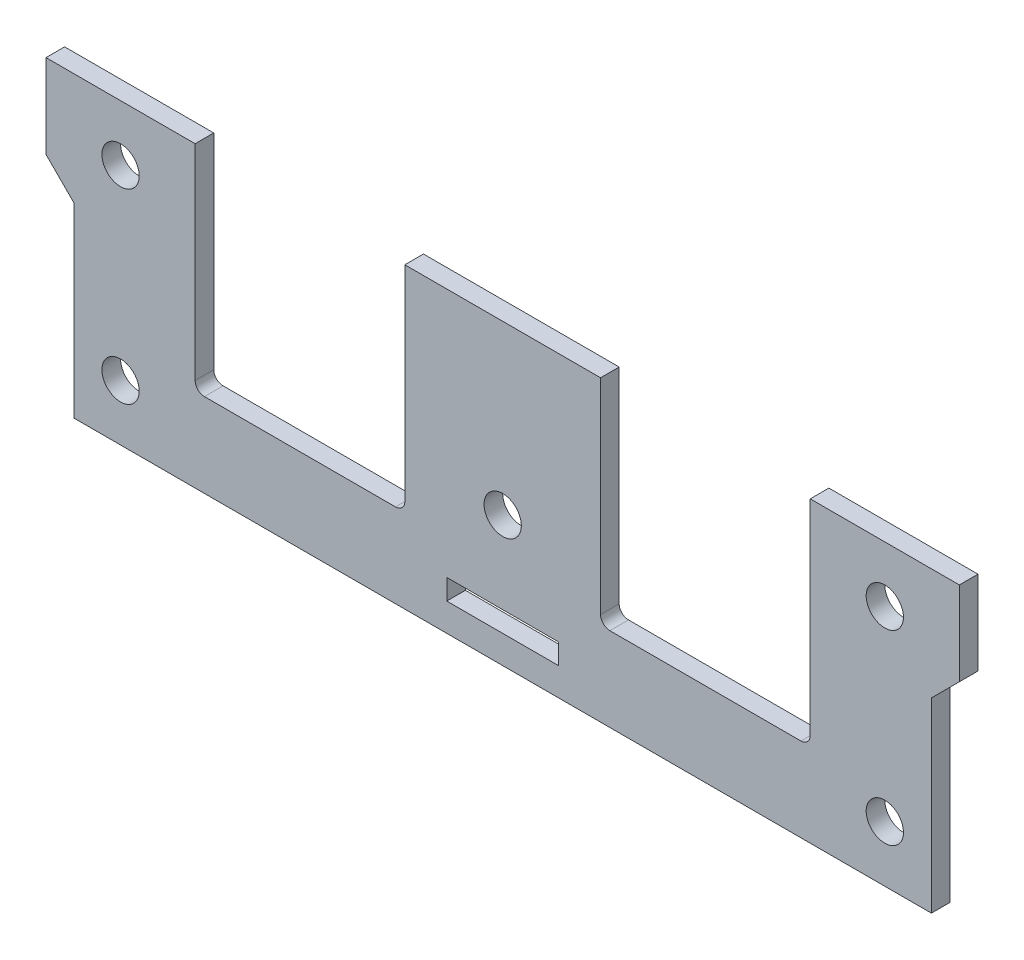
ISO-10303-21;
HEADER;
FILE_DESCRIPTION(('STEP AP214'),'2;1');
FILE_NAME('part.step','',(''),(''),'','','');
FILE_SCHEMA(('AUTOMOTIVE_DESIGN { 1 0 10303 214 1 1 1 1 }'));
ENDSEC;
DATA;
#1=APPLICATION_CONTEXT('core data for automotive mechanical design processes');
#2=APPLICATION_PROTOCOL_DEFINITION('international standard','automotive_design',2000,#1);
#3=PRODUCT_CONTEXT('',#1,'mechanical');
#4=PRODUCT('Part','Part','',(#3));
#5=PRODUCT_RELATED_PRODUCT_CATEGORY('part','',(#4));
#6=PRODUCT_DEFINITION_FORMATION('','',#4);
#7=PRODUCT_DEFINITION_CONTEXT('part definition',#1,'design');
#8=PRODUCT_DEFINITION('design','',#6,#7);
#9=PRODUCT_DEFINITION_SHAPE('','',#8);
#10=(LENGTH_UNIT() NAMED_UNIT(*) SI_UNIT(.MILLI.,.METRE.));
#11=(NAMED_UNIT(*) PLANE_ANGLE_UNIT() SI_UNIT($,.RADIAN.));
#12=(NAMED_UNIT(*) SI_UNIT($,.STERADIAN.) SOLID_ANGLE_UNIT());
#13=UNCERTAINTY_MEASURE_WITH_UNIT(LENGTH_MEASURE(1.E-05),#10,'distance_accuracy_value','');
#14=(GEOMETRIC_REPRESENTATION_CONTEXT(3) GLOBAL_UNCERTAINTY_ASSIGNED_CONTEXT((#13)) GLOBAL_UNIT_ASSIGNED_CONTEXT((#10,
#11,#12)) REPRESENTATION_CONTEXT('',''));
#15=CARTESIAN_POINT('',(0.,0.,0.));
#16=DIRECTION('',(0.,0.,1.));
#17=DIRECTION('',(1.,0.,0.));
#18=AXIS2_PLACEMENT_3D('',#15,#16,#17);
#19=CARTESIAN_POINT('',(24.,0.5,1.));
#20=DIRECTION('',(0.,0.,1.));
#21=DIRECTION('',(1.,0.,0.));
#22=AXIS2_PLACEMENT_3D('',#19,#20,#21);
#23=PLANE('',#22);
#24=DIRECTION('',(0.,-1.,0.));
#25=VECTOR('',#24,1.);
#26=CARTESIAN_POINT('',(23.,0.,1.));
#27=LINE('',#26,#25);
#28=CARTESIAN_POINT('',(23.,10.,1.));
#29=VERTEX_POINT('',#28);
#30=CARTESIAN_POINT('',(23.,0.,1.));
#31=VERTEX_POINT('',#30);
#32=EDGE_CURVE('E191',#29,#31,#27,.T.);
#33=ORIENTED_EDGE('',*,*,#32,.F.);
#34=DIRECTION('',(-0.707106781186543,-0.707106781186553,0.));
#35=VECTOR('',#34,1.);
#36=CARTESIAN_POINT('',(23.,10.,1.));
#37=LINE('',#36,#35);
#38=CARTESIAN_POINT('',(24.5,11.5,1.));
#39=VERTEX_POINT('',#38);
#40=EDGE_CURVE('E184',#29,#39,#37,.F.);
#41=ORIENTED_EDGE('',*,*,#40,.T.);
#42=DIRECTION('',(0.,1.,0.));
#43=VECTOR('',#42,1.);
#44=CARTESIAN_POINT('',(24.5,0.5,1.));
#45=LINE('',#44,#43);
#46=CARTESIAN_POINT('',(24.5,16.,1.));
#47=VERTEX_POINT('',#46);
#48=EDGE_CURVE('E188',#39,#47,#45,.T.);
#49=ORIENTED_EDGE('',*,*,#48,.T.);
#50=DIRECTION('',(-1.,0.,0.));
#51=VECTOR('',#50,1.);
#52=CARTESIAN_POINT('',(16.5,16.,1.));
#53=LINE('',#52,#51);
#54=CARTESIAN_POINT('',(16.5,16.,1.));
#55=VERTEX_POINT('',#54);
#56=EDGE_CURVE('E321',#47,#55,#53,.T.);
#57=ORIENTED_EDGE('',*,*,#56,.T.);
#58=DIRECTION('',(0.,-1.,0.));
#59=VECTOR('',#58,1.);
#60=CARTESIAN_POINT('',(16.5,16.,1.));
#61=LINE('',#60,#59);
#62=CARTESIAN_POINT('',(16.5,5.,1.));
#63=VERTEX_POINT('',#62);
#64=EDGE_CURVE('E323',#55,#63,#61,.T.);
#65=ORIENTED_EDGE('',*,*,#64,.T.);
#66=CARTESIAN_POINT('',(16.,5.,1.));
#67=DIRECTION('',(0.,0.,-1.));
#68=DIRECTION('',(1.,0.,0.));
#69=AXIS2_PLACEMENT_3D('',#66,#67,#68);
#70=CIRCLE('',#69,0.500000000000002);
#71=CARTESIAN_POINT('',(16.,4.5,1.));
#72=VERTEX_POINT('',#71);
#73=EDGE_CURVE('E325',#63,#72,#70,.T.);
#74=ORIENTED_EDGE('',*,*,#73,.T.);
#75=DIRECTION('',(-1.,0.,0.));
#76=VECTOR('',#75,1.);
#77=CARTESIAN_POINT('',(5.75,4.5,1.));
#78=LINE('',#77,#76);
#79=CARTESIAN_POINT('',(5.75,4.5,1.));
#80=VERTEX_POINT('',#79);
#81=EDGE_CURVE('E327',#72,#80,#78,.T.);
#82=ORIENTED_EDGE('',*,*,#81,.T.);
#83=CARTESIAN_POINT('',(5.74999999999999,5.,1.));
#84=DIRECTION('',(0.,0.,-1.));
#85=DIRECTION('',(1.,0.,0.));
#86=AXIS2_PLACEMENT_3D('',#83,#84,#85);
#87=CIRCLE('',#86,0.5);
#88=CARTESIAN_POINT('',(5.24999999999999,5.,1.));
#89=VERTEX_POINT('',#88);
#90=EDGE_CURVE('E329',#80,#89,#87,.T.);
#91=ORIENTED_EDGE('',*,*,#90,.T.);
#92=DIRECTION('',(0.,1.,0.));
#93=VECTOR('',#92,1.);
#94=CARTESIAN_POINT('',(5.25,16.,1.));
#95=LINE('',#94,#93);
#96=CARTESIAN_POINT('',(5.25,16.,1.));
#97=VERTEX_POINT('',#96);
#98=EDGE_CURVE('E331',#89,#97,#95,.T.);
#99=ORIENTED_EDGE('',*,*,#98,.T.);
#100=DIRECTION('',(-1.,0.,0.));
#101=VECTOR('',#100,1.);
#102=CARTESIAN_POINT('',(-5.25,16.,1.));
#103=LINE('',#102,#101);
#104=CARTESIAN_POINT('',(-5.25,16.,1.));
#105=VERTEX_POINT('',#104);
#106=EDGE_CURVE('E333',#97,#105,#103,.T.);
#107=ORIENTED_EDGE('',*,*,#106,.T.);
#108=DIRECTION('',(0.,-1.,0.));
#109=VECTOR('',#108,1.);
#110=CARTESIAN_POINT('',(-5.25,16.,1.));
#111=LINE('',#110,#109);
#112=CARTESIAN_POINT('',(-5.24999999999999,5.,1.));
#113=VERTEX_POINT('',#112);
#114=EDGE_CURVE('E335',#105,#113,#111,.T.);
#115=ORIENTED_EDGE('',*,*,#114,.T.);
#116=CARTESIAN_POINT('',(-5.74999999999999,5.,1.));
#117=DIRECTION('',(0.,0.,-1.));
#118=DIRECTION('',(1.,0.,0.));
#119=AXIS2_PLACEMENT_3D('',#116,#117,#118);
#120=CIRCLE('',#119,0.5);
#121=CARTESIAN_POINT('',(-5.75,4.5,1.));
#122=VERTEX_POINT('',#121);
#123=EDGE_CURVE('E337',#113,#122,#120,.T.);
#124=ORIENTED_EDGE('',*,*,#123,.T.);
#125=DIRECTION('',(-1.,0.,0.));
#126=VECTOR('',#125,1.);
#127=CARTESIAN_POINT('',(-16.,4.5,1.));
#128=LINE('',#127,#126);
#129=CARTESIAN_POINT('',(-16.,4.5,1.));
#130=VERTEX_POINT('',#129);
#131=EDGE_CURVE('E339',#122,#130,#128,.T.);
#132=ORIENTED_EDGE('',*,*,#131,.T.);
#133=CARTESIAN_POINT('',(-16.,5.,1.));
#134=DIRECTION('',(0.,0.,-1.));
#135=DIRECTION('',(1.,0.,0.));
#136=AXIS2_PLACEMENT_3D('',#133,#134,#135);
#137=CIRCLE('',#136,0.500000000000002);
#138=CARTESIAN_POINT('',(-16.5,5.,1.));
#139=VERTEX_POINT('',#138);
#140=EDGE_CURVE('E341',#130,#139,#137,.T.);
#141=ORIENTED_EDGE('',*,*,#140,.T.);
#142=DIRECTION('',(0.,1.,0.));
#143=VECTOR('',#142,1.);
#144=CARTESIAN_POINT('',(-16.5,16.,1.));
#145=LINE('',#144,#143);
#146=CARTESIAN_POINT('',(-16.5,16.,1.));
#147=VERTEX_POINT('',#146);
#148=EDGE_CURVE('E343',#139,#147,#145,.T.);
#149=ORIENTED_EDGE('',*,*,#148,.T.);
#150=DIRECTION('',(-1.,0.,0.));
#151=VECTOR('',#150,1.);
#152=CARTESIAN_POINT('',(-24.5,16.,1.));
#153=LINE('',#152,#151);
#154=CARTESIAN_POINT('',(-24.5,16.,1.));
#155=VERTEX_POINT('',#154);
#156=EDGE_CURVE('E345',#147,#155,#153,.T.);
#157=ORIENTED_EDGE('',*,*,#156,.T.);
#158=DIRECTION('',(0.,-1.,0.));
#159=VECTOR('',#158,1.);
#160=CARTESIAN_POINT('',(-24.5,0.5,1.));
#161=LINE('',#160,#159);
#162=CARTESIAN_POINT('',(-24.5,11.5,1.));
#163=VERTEX_POINT('',#162);
#164=EDGE_CURVE('E347',#155,#163,#161,.T.);
#165=ORIENTED_EDGE('',*,*,#164,.T.);
#166=DIRECTION('',(-0.707106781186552,0.707106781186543,0.));
#167=VECTOR('',#166,1.);
#168=CARTESIAN_POINT('',(-24.5,11.5,1.));
#169=LINE('',#168,#167);
#170=CARTESIAN_POINT('',(-23.,10.,1.));
#171=VERTEX_POINT('',#170);
#172=EDGE_CURVE('E34',#163,#171,#169,.F.);
#173=ORIENTED_EDGE('',*,*,#172,.T.);
#174=DIRECTION('',(0.,1.,0.));
#175=VECTOR('',#174,1.);
#176=CARTESIAN_POINT('',(-23.,0.,1.));
#177=LINE('',#176,#175);
#178=CARTESIAN_POINT('',(-23.,0.,1.));
#179=VERTEX_POINT('',#178);
#180=EDGE_CURVE('E213',#179,#171,#177,.T.);
#181=ORIENTED_EDGE('',*,*,#180,.F.);
#182=DIRECTION('',(1.,0.,0.));
#183=VECTOR('',#182,1.);
#184=CARTESIAN_POINT('',(-24.,0.,1.));
#185=LINE('',#184,#183);
#186=EDGE_CURVE('E205',#179,#31,#185,.T.);
#187=ORIENTED_EDGE('',*,*,#186,.T.);
#188=EDGE_LOOP('',(#33,#41,#49,#57,#65,#74,#82,#91,#99,#107,#115,#124,#132,#141,#149,#157,#165,
#173,#181,#187));
#189=FACE_BOUND('',#188,.T.);
#190=CARTESIAN_POINT('',(-20.5,3.,1.));
#191=DIRECTION('',(0.,0.,1.));
#192=DIRECTION('',(1.,0.,0.));
#193=AXIS2_PLACEMENT_3D('',#190,#191,#192);
#194=CIRCLE('',#193,1.);
#195=CARTESIAN_POINT('',(-19.5,3.,1.));
#196=VERTEX_POINT('',#195);
#197=EDGE_CURVE('E259',#196,#196,#194,.T.);
#198=ORIENTED_EDGE('',*,*,#197,.F.);
#199=EDGE_LOOP('',(#198));
#200=FACE_BOUND('',#199,.T.);
#201=CARTESIAN_POINT('',(0.,7.,1.));
#202=DIRECTION('',(0.,0.,1.));
#203=DIRECTION('',(1.,0.,0.));
#204=AXIS2_PLACEMENT_3D('',#201,#202,#203);
#205=CIRCLE('',#204,1.);
#206=CARTESIAN_POINT('',(1.,7.,1.));
#207=VERTEX_POINT('',#206);
#208=EDGE_CURVE('E271',#207,#207,#205,.T.);
#209=ORIENTED_EDGE('',*,*,#208,.F.);
#210=EDGE_LOOP('',(#209));
#211=FACE_BOUND('',#210,.T.);
#212=CARTESIAN_POINT('',(20.5,3.,1.));
#213=DIRECTION('',(0.,0.,1.));
#214=DIRECTION('',(1.,0.,0.));
#215=AXIS2_PLACEMENT_3D('',#212,#213,#214);
#216=CIRCLE('',#215,1.);
#217=CARTESIAN_POINT('',(21.5,3.,1.));
#218=VERTEX_POINT('',#217);
#219=EDGE_CURVE('E283',#218,#218,#216,.T.);
#220=ORIENTED_EDGE('',*,*,#219,.F.);
#221=EDGE_LOOP('',(#220));
#222=FACE_BOUND('',#221,.T.);
#223=CARTESIAN_POINT('',(20.5,13.,1.));
#224=DIRECTION('',(0.,0.,1.));
#225=DIRECTION('',(1.,0.,0.));
#226=AXIS2_PLACEMENT_3D('',#223,#224,#225);
#227=CIRCLE('',#226,1.);
#228=CARTESIAN_POINT('',(21.5,13.,1.));
#229=VERTEX_POINT('',#228);
#230=EDGE_CURVE('E277',#229,#229,#227,.T.);
#231=ORIENTED_EDGE('',*,*,#230,.F.);
#232=EDGE_LOOP('',(#231));
#233=FACE_BOUND('',#232,.T.);
#234=CARTESIAN_POINT('',(-20.5,13.,1.));
#235=DIRECTION('',(0.,0.,1.));
#236=DIRECTION('',(1.,0.,0.));
#237=AXIS2_PLACEMENT_3D('',#234,#235,#236);
#238=CIRCLE('',#237,1.);
#239=CARTESIAN_POINT('',(-19.5,13.,1.));
#240=VERTEX_POINT('',#239);
#241=EDGE_CURVE('E265',#240,#240,#238,.T.);
#242=ORIENTED_EDGE('',*,*,#241,.F.);
#243=EDGE_LOOP('',(#242));
#244=FACE_BOUND('',#243,.T.);
#245=DIRECTION('',(1.,0.,0.));
#246=VECTOR('',#245,1.);
#247=CARTESIAN_POINT('',(-3.,1.5,1.));
#248=LINE('',#247,#246);
#249=CARTESIAN_POINT('',(-3.,1.5,1.));
#250=VERTEX_POINT('',#249);
#251=CARTESIAN_POINT('',(3.,1.5,1.));
#252=VERTEX_POINT('',#251);
#253=EDGE_CURVE('E239',#250,#252,#248,.T.);
#254=ORIENTED_EDGE('',*,*,#253,.F.);
#255=DIRECTION('',(0.,-1.,0.));
#256=VECTOR('',#255,1.);
#257=CARTESIAN_POINT('',(-3.,2.6,1.));
#258=LINE('',#257,#256);
#259=CARTESIAN_POINT('',(-3.,2.6,1.));
#260=VERTEX_POINT('',#259);
#261=EDGE_CURVE('E237',#260,#250,#258,.T.);
#262=ORIENTED_EDGE('',*,*,#261,.F.);
#263=DIRECTION('',(-1.,0.,0.));
#264=VECTOR('',#263,1.);
#265=CARTESIAN_POINT('',(-3.,2.6,1.));
#266=LINE('',#265,#264);
#267=CARTESIAN_POINT('',(3.,2.6,1.));
#268=VERTEX_POINT('',#267);
#269=EDGE_CURVE('E244',#268,#260,#266,.T.);
#270=ORIENTED_EDGE('',*,*,#269,.F.);
#271=DIRECTION('',(0.,1.,0.));
#272=VECTOR('',#271,1.);
#273=CARTESIAN_POINT('',(3.,2.6,1.));
#274=LINE('',#273,#272);
#275=EDGE_CURVE('E241',#252,#268,#274,.T.);
#276=ORIENTED_EDGE('',*,*,#275,.F.);
#277=EDGE_LOOP('',(#254,#262,#270,#276));
#278=FACE_BOUND('',#277,.T.);
#279=ADVANCED_FACE('F26',(#189,#200,#211,#222,#233,#244,#278),#23,.T.);
#280=CARTESIAN_POINT('',(24.,0.5,0.));
#281=DIRECTION('',(0.,0.,1.));
#282=DIRECTION('',(1.,0.,0.));
#283=AXIS2_PLACEMENT_3D('',#280,#281,#282);
#284=PLANE('',#283);
#285=CARTESIAN_POINT('',(-20.5,3.,0.));
#286=DIRECTION('',(0.,0.,1.));
#287=DIRECTION('',(1.,0.,0.));
#288=AXIS2_PLACEMENT_3D('',#285,#286,#287);
#289=CIRCLE('',#288,1.);
#290=CARTESIAN_POINT('',(-19.5,3.,0.));
#291=VERTEX_POINT('',#290);
#292=EDGE_CURVE('E256',#291,#291,#289,.T.);
#293=ORIENTED_EDGE('',*,*,#292,.T.);
#294=EDGE_LOOP('',(#293));
#295=FACE_BOUND('',#294,.T.);
#296=CARTESIAN_POINT('',(0.,7.,0.));
#297=DIRECTION('',(0.,0.,1.));
#298=DIRECTION('',(1.,0.,0.));
#299=AXIS2_PLACEMENT_3D('',#296,#297,#298);
#300=CIRCLE('',#299,1.);
#301=CARTESIAN_POINT('',(1.,7.,0.));
#302=VERTEX_POINT('',#301);
#303=EDGE_CURVE('E268',#302,#302,#300,.T.);
#304=ORIENTED_EDGE('',*,*,#303,.T.);
#305=EDGE_LOOP('',(#304));
#306=FACE_BOUND('',#305,.T.);
#307=CARTESIAN_POINT('',(20.5,3.,0.));
#308=DIRECTION('',(0.,0.,1.));
#309=DIRECTION('',(1.,0.,0.));
#310=AXIS2_PLACEMENT_3D('',#307,#308,#309);
#311=CIRCLE('',#310,1.);
#312=CARTESIAN_POINT('',(21.5,3.,0.));
#313=VERTEX_POINT('',#312);
#314=EDGE_CURVE('E280',#313,#313,#311,.T.);
#315=ORIENTED_EDGE('',*,*,#314,.T.);
#316=EDGE_LOOP('',(#315));
#317=FACE_BOUND('',#316,.T.);
#318=DIRECTION('',(0.,1.,0.));
#319=VECTOR('',#318,1.);
#320=CARTESIAN_POINT('',(24.5,0.5,0.));
#321=LINE('',#320,#319);
#322=CARTESIAN_POINT('',(24.5,11.5,0.));
#323=VERTEX_POINT('',#322);
#324=CARTESIAN_POINT('',(24.5,16.,0.));
#325=VERTEX_POINT('',#324);
#326=EDGE_CURVE('E319',#323,#325,#321,.T.);
#327=ORIENTED_EDGE('',*,*,#326,.F.);
#328=DIRECTION('',(0.707106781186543,0.707106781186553,0.));
#329=VECTOR('',#328,1.);
#330=CARTESIAN_POINT('',(18.75,5.74999999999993,0.));
#331=LINE('',#330,#329);
#332=CARTESIAN_POINT('',(23.,10.,0.));
#333=VERTEX_POINT('',#332);
#334=EDGE_CURVE('E196',#323,#333,#331,.F.);
#335=ORIENTED_EDGE('',*,*,#334,.T.);
#336=DIRECTION('',(0.,-1.,0.));
#337=VECTOR('',#336,1.);
#338=CARTESIAN_POINT('',(23.,0.,0.));
#339=LINE('',#338,#337);
#340=CARTESIAN_POINT('',(23.,0.,0.));
#341=VERTEX_POINT('',#340);
#342=EDGE_CURVE('E210',#333,#341,#339,.T.);
#343=ORIENTED_EDGE('',*,*,#342,.T.);
#344=DIRECTION('',(1.,0.,0.));
#345=VECTOR('',#344,1.);
#346=CARTESIAN_POINT('',(-24.,0.,0.));
#347=LINE('',#346,#345);
#348=CARTESIAN_POINT('',(-23.,0.,0.));
#349=VERTEX_POINT('',#348);
#350=EDGE_CURVE('E316',#349,#341,#347,.T.);
#351=ORIENTED_EDGE('',*,*,#350,.F.);
#352=DIRECTION('',(0.,1.,0.));
#353=VECTOR('',#352,1.);
#354=CARTESIAN_POINT('',(-23.,0.,0.));
#355=LINE('',#354,#353);
#356=CARTESIAN_POINT('',(-23.,10.,0.));
#357=VERTEX_POINT('',#356);
#358=EDGE_CURVE('E218',#349,#357,#355,.T.);
#359=ORIENTED_EDGE('',*,*,#358,.T.);
#360=DIRECTION('',(0.707106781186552,-0.707106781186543,0.));
#361=VECTOR('',#360,1.);
#362=CARTESIAN_POINT('',(5.25000000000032,-18.2499999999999,0.));
#363=LINE('',#362,#361);
#364=CARTESIAN_POINT('',(-24.5,11.5,0.));
#365=VERTEX_POINT('',#364);
#366=EDGE_CURVE('E11',#357,#365,#363,.F.);
#367=ORIENTED_EDGE('',*,*,#366,.T.);
#368=DIRECTION('',(0.,-1.,0.));
#369=VECTOR('',#368,1.);
#370=CARTESIAN_POINT('',(-24.5,0.5,0.));
#371=LINE('',#370,#369);
#372=CARTESIAN_POINT('',(-24.5,16.,0.));
#373=VERTEX_POINT('',#372);
#374=EDGE_CURVE('E313',#373,#365,#371,.T.);
#375=ORIENTED_EDGE('',*,*,#374,.F.);
#376=DIRECTION('',(-1.,0.,0.));
#377=VECTOR('',#376,1.);
#378=CARTESIAN_POINT('',(-24.5,16.,0.));
#379=LINE('',#378,#377);
#380=CARTESIAN_POINT('',(-16.5,16.,0.));
#381=VERTEX_POINT('',#380);
#382=EDGE_CURVE('E311',#381,#373,#379,.T.);
#383=ORIENTED_EDGE('',*,*,#382,.F.);
#384=DIRECTION('',(0.,1.,0.));
#385=VECTOR('',#384,1.);
#386=CARTESIAN_POINT('',(-16.5,16.,0.));
#387=LINE('',#386,#385);
#388=CARTESIAN_POINT('',(-16.5,5.,0.));
#389=VERTEX_POINT('',#388);
#390=EDGE_CURVE('E309',#389,#381,#387,.T.);
#391=ORIENTED_EDGE('',*,*,#390,.F.);
#392=CARTESIAN_POINT('',(-16.,5.,0.));
#393=DIRECTION('',(0.,0.,-1.));
#394=DIRECTION('',(1.,0.,0.));
#395=AXIS2_PLACEMENT_3D('',#392,#393,#394);
#396=CIRCLE('',#395,0.500000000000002);
#397=CARTESIAN_POINT('',(-16.,4.5,0.));
#398=VERTEX_POINT('',#397);
#399=EDGE_CURVE('E307',#398,#389,#396,.T.);
#400=ORIENTED_EDGE('',*,*,#399,.F.);
#401=DIRECTION('',(-1.,0.,0.));
#402=VECTOR('',#401,1.);
#403=CARTESIAN_POINT('',(-16.,4.5,0.));
#404=LINE('',#403,#402);
#405=CARTESIAN_POINT('',(-5.75,4.5,0.));
#406=VERTEX_POINT('',#405);
#407=EDGE_CURVE('E305',#406,#398,#404,.T.);
#408=ORIENTED_EDGE('',*,*,#407,.F.);
#409=CARTESIAN_POINT('',(-5.74999999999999,5.,0.));
#410=DIRECTION('',(0.,0.,-1.));
#411=DIRECTION('',(1.,0.,0.));
#412=AXIS2_PLACEMENT_3D('',#409,#410,#411);
#413=CIRCLE('',#412,0.5);
#414=CARTESIAN_POINT('',(-5.24999999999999,5.,0.));
#415=VERTEX_POINT('',#414);
#416=EDGE_CURVE('E303',#415,#406,#413,.T.);
#417=ORIENTED_EDGE('',*,*,#416,.F.);
#418=DIRECTION('',(0.,-1.,0.));
#419=VECTOR('',#418,1.);
#420=CARTESIAN_POINT('',(-5.25,16.,0.));
#421=LINE('',#420,#419);
#422=CARTESIAN_POINT('',(-5.25,16.,0.));
#423=VERTEX_POINT('',#422);
#424=EDGE_CURVE('E301',#423,#415,#421,.T.);
#425=ORIENTED_EDGE('',*,*,#424,.F.);
#426=DIRECTION('',(-1.,0.,0.));
#427=VECTOR('',#426,1.);
#428=CARTESIAN_POINT('',(-5.25,16.,0.));
#429=LINE('',#428,#427);
#430=CARTESIAN_POINT('',(5.25,16.,0.));
#431=VERTEX_POINT('',#430);
#432=EDGE_CURVE('E299',#431,#423,#429,.T.);
#433=ORIENTED_EDGE('',*,*,#432,.F.);
#434=DIRECTION('',(0.,1.,0.));
#435=VECTOR('',#434,1.);
#436=CARTESIAN_POINT('',(5.25,16.,0.));
#437=LINE('',#436,#435);
#438=CARTESIAN_POINT('',(5.24999999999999,5.,0.));
#439=VERTEX_POINT('',#438);
#440=EDGE_CURVE('E297',#439,#431,#437,.T.);
#441=ORIENTED_EDGE('',*,*,#440,.F.);
#442=CARTESIAN_POINT('',(5.74999999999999,5.,0.));
#443=DIRECTION('',(0.,0.,-1.));
#444=DIRECTION('',(1.,0.,0.));
#445=AXIS2_PLACEMENT_3D('',#442,#443,#444);
#446=CIRCLE('',#445,0.5);
#447=CARTESIAN_POINT('',(5.75,4.5,0.));
#448=VERTEX_POINT('',#447);
#449=EDGE_CURVE('E295',#448,#439,#446,.T.);
#450=ORIENTED_EDGE('',*,*,#449,.F.);
#451=DIRECTION('',(-1.,0.,0.));
#452=VECTOR('',#451,1.);
#453=CARTESIAN_POINT('',(5.75,4.5,0.));
#454=LINE('',#453,#452);
#455=CARTESIAN_POINT('',(16.,4.5,0.));
#456=VERTEX_POINT('',#455);
#457=EDGE_CURVE('E293',#456,#448,#454,.T.);
#458=ORIENTED_EDGE('',*,*,#457,.F.);
#459=CARTESIAN_POINT('',(16.,5.,0.));
#460=DIRECTION('',(0.,0.,-1.));
#461=DIRECTION('',(1.,0.,0.));
#462=AXIS2_PLACEMENT_3D('',#459,#460,#461);
#463=CIRCLE('',#462,0.500000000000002);
#464=CARTESIAN_POINT('',(16.5,5.,0.));
#465=VERTEX_POINT('',#464);
#466=EDGE_CURVE('E291',#465,#456,#463,.T.);
#467=ORIENTED_EDGE('',*,*,#466,.F.);
#468=DIRECTION('',(0.,-1.,0.));
#469=VECTOR('',#468,1.);
#470=CARTESIAN_POINT('',(16.5,16.,0.));
#471=LINE('',#470,#469);
#472=CARTESIAN_POINT('',(16.5,16.,0.));
#473=VERTEX_POINT('',#472);
#474=EDGE_CURVE('E289',#473,#465,#471,.T.);
#475=ORIENTED_EDGE('',*,*,#474,.F.);
#476=DIRECTION('',(-1.,0.,0.));
#477=VECTOR('',#476,1.);
#478=CARTESIAN_POINT('',(16.5,16.,0.));
#479=LINE('',#478,#477);
#480=EDGE_CURVE('E286',#325,#473,#479,.T.);
#481=ORIENTED_EDGE('',*,*,#480,.F.);
#482=EDGE_LOOP('',(#327,#335,#343,#351,#359,#367,#375,#383,#391,#400,#408,#417,#425,#433,#441,
#450,#458,#467,#475,#481));
#483=FACE_BOUND('',#482,.T.);
#484=CARTESIAN_POINT('',(20.5,13.,0.));
#485=DIRECTION('',(0.,0.,1.));
#486=DIRECTION('',(1.,0.,0.));
#487=AXIS2_PLACEMENT_3D('',#484,#485,#486);
#488=CIRCLE('',#487,1.);
#489=CARTESIAN_POINT('',(21.5,13.,0.));
#490=VERTEX_POINT('',#489);
#491=EDGE_CURVE('E274',#490,#490,#488,.T.);
#492=ORIENTED_EDGE('',*,*,#491,.T.);
#493=EDGE_LOOP('',(#492));
#494=FACE_BOUND('',#493,.T.);
#495=CARTESIAN_POINT('',(-20.5,13.,0.));
#496=DIRECTION('',(0.,0.,1.));
#497=DIRECTION('',(1.,0.,0.));
#498=AXIS2_PLACEMENT_3D('',#495,#496,#497);
#499=CIRCLE('',#498,1.);
#500=CARTESIAN_POINT('',(-19.5,13.,0.));
#501=VERTEX_POINT('',#500);
#502=EDGE_CURVE('E262',#501,#501,#499,.T.);
#503=ORIENTED_EDGE('',*,*,#502,.T.);
#504=EDGE_LOOP('',(#503));
#505=FACE_BOUND('',#504,.T.);
#506=DIRECTION('',(0.,-1.,0.));
#507=VECTOR('',#506,1.);
#508=CARTESIAN_POINT('',(-3.,2.6,0.));
#509=LINE('',#508,#507);
#510=CARTESIAN_POINT('',(-3.,2.6,0.));
#511=VERTEX_POINT('',#510);
#512=CARTESIAN_POINT('',(-3.,1.5,0.));
#513=VERTEX_POINT('',#512);
#514=EDGE_CURVE('E223',#511,#513,#509,.T.);
#515=ORIENTED_EDGE('',*,*,#514,.T.);
#516=DIRECTION('',(1.,0.,0.));
#517=VECTOR('',#516,1.);
#518=CARTESIAN_POINT('',(-3.,1.5,0.));
#519=LINE('',#518,#517);
#520=CARTESIAN_POINT('',(3.,1.5,0.));
#521=VERTEX_POINT('',#520);
#522=EDGE_CURVE('E228',#513,#521,#519,.T.);
#523=ORIENTED_EDGE('',*,*,#522,.T.);
#524=DIRECTION('',(0.,1.,0.));
#525=VECTOR('',#524,1.);
#526=CARTESIAN_POINT('',(3.,2.6,0.));
#527=LINE('',#526,#525);
#528=CARTESIAN_POINT('',(3.,2.6,0.));
#529=VERTEX_POINT('',#528);
#530=EDGE_CURVE('E231',#521,#529,#527,.T.);
#531=ORIENTED_EDGE('',*,*,#530,.T.);
#532=DIRECTION('',(-1.,0.,0.));
#533=VECTOR('',#532,1.);
#534=CARTESIAN_POINT('',(-3.,2.6,0.));
#535=LINE('',#534,#533);
#536=EDGE_CURVE('E234',#529,#511,#535,.T.);
#537=ORIENTED_EDGE('',*,*,#536,.T.);
#538=EDGE_LOOP('',(#515,#523,#531,#537));
#539=FACE_BOUND('',#538,.T.);
#540=ADVANCED_FACE('F395',(#295,#306,#317,#483,#494,#505,#539),#284,.F.);
#541=CARTESIAN_POINT('',(16.5,16.,1.));
#542=DIRECTION('',(0.,-1.,0.));
#543=DIRECTION('',(0.,0.,-1.));
#544=AXIS2_PLACEMENT_3D('',#541,#542,#543);
#545=PLANE('',#544);
#546=ORIENTED_EDGE('',*,*,#480,.T.);
#547=DIRECTION('',(0.,0.,-1.));
#548=VECTOR('',#547,1.);
#549=CARTESIAN_POINT('',(16.5,16.,1.));
#550=LINE('',#549,#548);
#551=EDGE_CURVE('E387',#55,#473,#550,.T.);
#552=ORIENTED_EDGE('',*,*,#551,.F.);
#553=ORIENTED_EDGE('',*,*,#56,.F.);
#554=DIRECTION('',(0.,0.,-1.));
#555=VECTOR('',#554,1.);
#556=CARTESIAN_POINT('',(24.5,16.,1.));
#557=LINE('',#556,#555);
#558=EDGE_CURVE('E203',#47,#325,#557,.T.);
#559=ORIENTED_EDGE('',*,*,#558,.T.);
#560=EDGE_LOOP('',(#546,#552,#553,#559));
#561=FACE_BOUND('',#560,.T.);
#562=ADVANCED_FACE('F28',(#561),#545,.F.);
#563=CARTESIAN_POINT('',(16.5,16.,1.));
#564=DIRECTION('',(1.,0.,0.));
#565=DIRECTION('',(0.,1.,0.));
#566=AXIS2_PLACEMENT_3D('',#563,#564,#565);
#567=PLANE('',#566);
#568=ORIENTED_EDGE('',*,*,#474,.T.);
#569=DIRECTION('',(0.,0.,-1.));
#570=VECTOR('',#569,1.);
#571=CARTESIAN_POINT('',(16.5,5.,1.));
#572=LINE('',#571,#570);
#573=EDGE_CURVE('E384',#63,#465,#572,.T.);
#574=ORIENTED_EDGE('',*,*,#573,.F.);
#575=ORIENTED_EDGE('',*,*,#64,.F.);
#576=ORIENTED_EDGE('',*,*,#551,.T.);
#577=EDGE_LOOP('',(#568,#574,#575,#576));
#578=FACE_BOUND('',#577,.T.);
#579=ADVANCED_FACE('F471',(#578),#567,.F.);
#580=CARTESIAN_POINT('',(16.,5.,1.));
#581=DIRECTION('',(0.,0.,-1.));
#582=DIRECTION('',(-1.,0.,0.));
#583=AXIS2_PLACEMENT_3D('',#580,#581,#582);
#584=CYLINDRICAL_SURFACE('',#583,0.500000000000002);
#585=ORIENTED_EDGE('',*,*,#466,.T.);
#586=DIRECTION('',(0.,0.,-1.));
#587=VECTOR('',#586,1.);
#588=CARTESIAN_POINT('',(16.,4.5,1.));
#589=LINE('',#588,#587);
#590=EDGE_CURVE('E381',#72,#456,#589,.T.);
#591=ORIENTED_EDGE('',*,*,#590,.F.);
#592=ORIENTED_EDGE('',*,*,#73,.F.);
#593=ORIENTED_EDGE('',*,*,#573,.T.);
#594=EDGE_LOOP('',(#585,#591,#592,#593));
#595=FACE_BOUND('',#594,.T.);
#596=ADVANCED_FACE('F467',(#595),#584,.F.);
#597=CARTESIAN_POINT('',(5.75,4.5,1.));
#598=DIRECTION('',(0.,-1.,0.));
#599=DIRECTION('',(1.,0.,0.));
#600=AXIS2_PLACEMENT_3D('',#597,#598,#599);
#601=PLANE('',#600);
#602=ORIENTED_EDGE('',*,*,#457,.T.);
#603=DIRECTION('',(0.,0.,-1.));
#604=VECTOR('',#603,1.);
#605=CARTESIAN_POINT('',(5.75,4.5,1.));
#606=LINE('',#605,#604);
#607=EDGE_CURVE('E378',#80,#448,#606,.T.);
#608=ORIENTED_EDGE('',*,*,#607,.F.);
#609=ORIENTED_EDGE('',*,*,#81,.F.);
#610=ORIENTED_EDGE('',*,*,#590,.T.);
#611=EDGE_LOOP('',(#602,#608,#609,#610));
#612=FACE_BOUND('',#611,.T.);
#613=ADVANCED_FACE('F463',(#612),#601,.F.);
#614=CARTESIAN_POINT('',(5.74999999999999,5.,1.));
#615=DIRECTION('',(0.,0.,-1.));
#616=DIRECTION('',(-1.,0.,0.));
#617=AXIS2_PLACEMENT_3D('',#614,#615,#616);
#618=CYLINDRICAL_SURFACE('',#617,0.5);
#619=ORIENTED_EDGE('',*,*,#449,.T.);
#620=DIRECTION('',(0.,0.,-1.));
#621=VECTOR('',#620,1.);
#622=CARTESIAN_POINT('',(5.24999999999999,5.,1.));
#623=LINE('',#622,#621);
#624=EDGE_CURVE('E375',#89,#439,#623,.T.);
#625=ORIENTED_EDGE('',*,*,#624,.F.);
#626=ORIENTED_EDGE('',*,*,#90,.F.);
#627=ORIENTED_EDGE('',*,*,#607,.T.);
#628=EDGE_LOOP('',(#619,#625,#626,#627));
#629=FACE_BOUND('',#628,.T.);
#630=ADVANCED_FACE('F459',(#629),#618,.F.);
#631=CARTESIAN_POINT('',(5.25,16.,1.));
#632=DIRECTION('',(-1.,0.,0.));
#633=DIRECTION('',(0.,-1.,0.));
#634=AXIS2_PLACEMENT_3D('',#631,#632,#633);
#635=PLANE('',#634);
#636=ORIENTED_EDGE('',*,*,#440,.T.);
#637=DIRECTION('',(0.,0.,-1.));
#638=VECTOR('',#637,1.);
#639=CARTESIAN_POINT('',(5.25,16.,1.));
#640=LINE('',#639,#638);
#641=EDGE_CURVE('E372',#97,#431,#640,.T.);
#642=ORIENTED_EDGE('',*,*,#641,.F.);
#643=ORIENTED_EDGE('',*,*,#98,.F.);
#644=ORIENTED_EDGE('',*,*,#624,.T.);
#645=EDGE_LOOP('',(#636,#642,#643,#644));
#646=FACE_BOUND('',#645,.T.);
#647=ADVANCED_FACE('F454',(#646),#635,.F.);
#648=CARTESIAN_POINT('',(-5.25,16.,1.));
#649=DIRECTION('',(0.,-1.,0.));
#650=DIRECTION('',(0.,0.,-1.));
#651=AXIS2_PLACEMENT_3D('',#648,#649,#650);
#652=PLANE('',#651);
#653=ORIENTED_EDGE('',*,*,#432,.T.);
#654=DIRECTION('',(0.,0.,-1.));
#655=VECTOR('',#654,1.);
#656=CARTESIAN_POINT('',(-5.25,16.,1.));
#657=LINE('',#656,#655);
#658=EDGE_CURVE('E369',#105,#423,#657,.T.);
#659=ORIENTED_EDGE('',*,*,#658,.F.);
#660=ORIENTED_EDGE('',*,*,#106,.F.);
#661=ORIENTED_EDGE('',*,*,#641,.T.);
#662=EDGE_LOOP('',(#653,#659,#660,#661));
#663=FACE_BOUND('',#662,.T.);
#664=ADVANCED_FACE('F448',(#663),#652,.F.);
#665=CARTESIAN_POINT('',(-5.25,16.,1.));
#666=DIRECTION('',(1.,0.,0.));
#667=DIRECTION('',(0.,1.,0.));
#668=AXIS2_PLACEMENT_3D('',#665,#666,#667);
#669=PLANE('',#668);
#670=ORIENTED_EDGE('',*,*,#424,.T.);
#671=DIRECTION('',(0.,0.,-1.));
#672=VECTOR('',#671,1.);
#673=CARTESIAN_POINT('',(-5.24999999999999,5.,1.));
#674=LINE('',#673,#672);
#675=EDGE_CURVE('E366',#113,#415,#674,.T.);
#676=ORIENTED_EDGE('',*,*,#675,.F.);
#677=ORIENTED_EDGE('',*,*,#114,.F.);
#678=ORIENTED_EDGE('',*,*,#658,.T.);
#679=EDGE_LOOP('',(#670,#676,#677,#678));
#680=FACE_BOUND('',#679,.T.);
#681=ADVANCED_FACE('F444',(#680),#669,.F.);
#682=CARTESIAN_POINT('',(-5.74999999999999,5.,1.));
#683=DIRECTION('',(0.,0.,-1.));
#684=DIRECTION('',(-1.,0.,0.));
#685=AXIS2_PLACEMENT_3D('',#682,#683,#684);
#686=CYLINDRICAL_SURFACE('',#685,0.5);
#687=ORIENTED_EDGE('',*,*,#416,.T.);
#688=DIRECTION('',(0.,0.,-1.));
#689=VECTOR('',#688,1.);
#690=CARTESIAN_POINT('',(-5.75,4.5,1.));
#691=LINE('',#690,#689);
#692=EDGE_CURVE('E363',#122,#406,#691,.T.);
#693=ORIENTED_EDGE('',*,*,#692,.F.);
#694=ORIENTED_EDGE('',*,*,#123,.F.);
#695=ORIENTED_EDGE('',*,*,#675,.T.);
#696=EDGE_LOOP('',(#687,#693,#694,#695));
#697=FACE_BOUND('',#696,.T.);
#698=ADVANCED_FACE('F439',(#697),#686,.F.);
#699=CARTESIAN_POINT('',(-16.,4.5,1.));
#700=DIRECTION('',(0.,-1.,0.));
#701=DIRECTION('',(1.,0.,0.));
#702=AXIS2_PLACEMENT_3D('',#699,#700,#701);
#703=PLANE('',#702);
#704=ORIENTED_EDGE('',*,*,#407,.T.);
#705=DIRECTION('',(0.,0.,-1.));
#706=VECTOR('',#705,1.);
#707=CARTESIAN_POINT('',(-16.,4.5,1.));
#708=LINE('',#707,#706);
#709=EDGE_CURVE('E360',#130,#398,#708,.T.);
#710=ORIENTED_EDGE('',*,*,#709,.F.);
#711=ORIENTED_EDGE('',*,*,#131,.F.);
#712=ORIENTED_EDGE('',*,*,#692,.T.);
#713=EDGE_LOOP('',(#704,#710,#711,#712));
#714=FACE_BOUND('',#713,.T.);
#715=ADVANCED_FACE('F433',(#714),#703,.F.);
#716=CARTESIAN_POINT('',(-16.,5.,1.));
#717=DIRECTION('',(0.,0.,-1.));
#718=DIRECTION('',(-1.,0.,0.));
#719=AXIS2_PLACEMENT_3D('',#716,#717,#718);
#720=CYLINDRICAL_SURFACE('',#719,0.500000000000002);
#721=ORIENTED_EDGE('',*,*,#399,.T.);
#722=DIRECTION('',(0.,0.,-1.));
#723=VECTOR('',#722,1.);
#724=CARTESIAN_POINT('',(-16.5,5.,1.));
#725=LINE('',#724,#723);
#726=EDGE_CURVE('E357',#139,#389,#725,.T.);
#727=ORIENTED_EDGE('',*,*,#726,.F.);
#728=ORIENTED_EDGE('',*,*,#140,.F.);
#729=ORIENTED_EDGE('',*,*,#709,.T.);
#730=EDGE_LOOP('',(#721,#727,#728,#729));
#731=FACE_BOUND('',#730,.T.);
#732=ADVANCED_FACE('F429',(#731),#720,.F.);
#733=CARTESIAN_POINT('',(-16.5,16.,1.));
#734=DIRECTION('',(-1.,0.,0.));
#735=DIRECTION('',(0.,-1.,0.));
#736=AXIS2_PLACEMENT_3D('',#733,#734,#735);
#737=PLANE('',#736);
#738=ORIENTED_EDGE('',*,*,#390,.T.);
#739=DIRECTION('',(0.,0.,-1.));
#740=VECTOR('',#739,1.);
#741=CARTESIAN_POINT('',(-16.5,16.,1.));
#742=LINE('',#741,#740);
#743=EDGE_CURVE('E354',#147,#381,#742,.T.);
#744=ORIENTED_EDGE('',*,*,#743,.F.);
#745=ORIENTED_EDGE('',*,*,#148,.F.);
#746=ORIENTED_EDGE('',*,*,#726,.T.);
#747=EDGE_LOOP('',(#738,#744,#745,#746));
#748=FACE_BOUND('',#747,.T.);
#749=ADVANCED_FACE('F425',(#748),#737,.F.);
#750=CARTESIAN_POINT('',(-24.5,16.,1.));
#751=DIRECTION('',(0.,-1.,0.));
#752=DIRECTION('',(0.,0.,-1.));
#753=AXIS2_PLACEMENT_3D('',#750,#751,#752);
#754=PLANE('',#753);
#755=ORIENTED_EDGE('',*,*,#382,.T.);
#756=DIRECTION('',(0.,0.,-1.));
#757=VECTOR('',#756,1.);
#758=CARTESIAN_POINT('',(-24.5,16.,1.));
#759=LINE('',#758,#757);
#760=EDGE_CURVE('E351',#155,#373,#759,.T.);
#761=ORIENTED_EDGE('',*,*,#760,.F.);
#762=ORIENTED_EDGE('',*,*,#156,.F.);
#763=ORIENTED_EDGE('',*,*,#743,.T.);
#764=EDGE_LOOP('',(#755,#761,#762,#763));
#765=FACE_BOUND('',#764,.T.);
#766=ADVANCED_FACE('F419',(#765),#754,.F.);
#767=CARTESIAN_POINT('',(-24.5,0.5,1.));
#768=DIRECTION('',(1.,0.,0.));
#769=DIRECTION('',(0.,1.,0.));
#770=AXIS2_PLACEMENT_3D('',#767,#768,#769);
#771=PLANE('',#770);
#772=ORIENTED_EDGE('',*,*,#374,.T.);
#773=DIRECTION('',(0.,0.,1.));
#774=VECTOR('',#773,1.);
#775=CARTESIAN_POINT('',(-24.5,11.5,0.));
#776=LINE('',#775,#774);
#777=EDGE_CURVE('E220',#365,#163,#776,.T.);
#778=ORIENTED_EDGE('',*,*,#777,.T.);
#779=ORIENTED_EDGE('',*,*,#164,.F.);
#780=ORIENTED_EDGE('',*,*,#760,.T.);
#781=EDGE_LOOP('',(#772,#778,#779,#780));
#782=FACE_BOUND('',#781,.T.);
#783=ADVANCED_FACE('F413',(#782),#771,.F.);
#784=CARTESIAN_POINT('',(-24.,0.,1.));
#785=DIRECTION('',(0.,1.,0.));
#786=DIRECTION('',(-1.,0.,0.));
#787=AXIS2_PLACEMENT_3D('',#784,#785,#786);
#788=PLANE('',#787);
#789=ORIENTED_EDGE('',*,*,#350,.T.);
#790=DIRECTION('',(0.,0.,1.));
#791=VECTOR('',#790,1.);
#792=CARTESIAN_POINT('',(23.,0.,0.));
#793=LINE('',#792,#791);
#794=EDGE_CURVE('E209',#341,#31,#793,.T.);
#795=ORIENTED_EDGE('',*,*,#794,.T.);
#796=ORIENTED_EDGE('',*,*,#186,.F.);
#797=DIRECTION('',(0.,0.,1.));
#798=VECTOR('',#797,1.);
#799=CARTESIAN_POINT('',(-23.,0.,0.));
#800=LINE('',#799,#798);
#801=EDGE_CURVE('E221',#349,#179,#800,.T.);
#802=ORIENTED_EDGE('',*,*,#801,.F.);
#803=EDGE_LOOP('',(#789,#795,#796,#802));
#804=FACE_BOUND('',#803,.T.);
#805=ADVANCED_FACE('F405',(#804),#788,.F.);
#806=CARTESIAN_POINT('',(24.5,0.5,1.));
#807=DIRECTION('',(-1.,0.,0.));
#808=DIRECTION('',(0.,-1.,0.));
#809=AXIS2_PLACEMENT_3D('',#806,#807,#808);
#810=PLANE('',#809);
#811=ORIENTED_EDGE('',*,*,#48,.F.);
#812=DIRECTION('',(0.,0.,1.));
#813=VECTOR('',#812,1.);
#814=CARTESIAN_POINT('',(24.5,11.5,0.));
#815=LINE('',#814,#813);
#816=EDGE_CURVE('E200',#323,#39,#815,.T.);
#817=ORIENTED_EDGE('',*,*,#816,.F.);
#818=ORIENTED_EDGE('',*,*,#326,.T.);
#819=ORIENTED_EDGE('',*,*,#558,.F.);
#820=EDGE_LOOP('',(#811,#817,#818,#819));
#821=FACE_BOUND('',#820,.T.);
#822=ADVANCED_FACE('F199',(#821),#810,.F.);
#823=CARTESIAN_POINT('',(20.5,3.,1.));
#824=DIRECTION('',(0.,0.,-1.));
#825=DIRECTION('',(-1.,0.,0.));
#826=AXIS2_PLACEMENT_3D('',#823,#824,#825);
#827=CYLINDRICAL_SURFACE('',#826,1.);
#828=ORIENTED_EDGE('',*,*,#219,.T.);
#829=EDGE_LOOP('',(#828));
#830=FACE_BOUND('',#829,.T.);
#831=ORIENTED_EDGE('',*,*,#314,.F.);
#832=EDGE_LOOP('',(#831));
#833=FACE_BOUND('',#832,.T.);
#834=ADVANCED_FACE('F490',(#830,#833),#827,.F.);
#835=CARTESIAN_POINT('',(20.5,13.,1.));
#836=DIRECTION('',(0.,0.,-1.));
#837=DIRECTION('',(-1.,0.,0.));
#838=AXIS2_PLACEMENT_3D('',#835,#836,#837);
#839=CYLINDRICAL_SURFACE('',#838,1.);
#840=ORIENTED_EDGE('',*,*,#230,.T.);
#841=EDGE_LOOP('',(#840));
#842=FACE_BOUND('',#841,.T.);
#843=ORIENTED_EDGE('',*,*,#491,.F.);
#844=EDGE_LOOP('',(#843));
#845=FACE_BOUND('',#844,.T.);
#846=ADVANCED_FACE('F566',(#842,#845),#839,.F.);
#847=CARTESIAN_POINT('',(0.,7.,1.));
#848=DIRECTION('',(0.,0.,-1.));
#849=DIRECTION('',(-1.,0.,0.));
#850=AXIS2_PLACEMENT_3D('',#847,#848,#849);
#851=CYLINDRICAL_SURFACE('',#850,1.);
#852=ORIENTED_EDGE('',*,*,#208,.T.);
#853=EDGE_LOOP('',(#852));
#854=FACE_BOUND('',#853,.T.);
#855=ORIENTED_EDGE('',*,*,#303,.F.);
#856=EDGE_LOOP('',(#855));
#857=FACE_BOUND('',#856,.T.);
#858=ADVANCED_FACE('F574',(#854,#857),#851,.F.);
#859=CARTESIAN_POINT('',(-20.5,13.,1.));
#860=DIRECTION('',(0.,0.,-1.));
#861=DIRECTION('',(-1.,0.,0.));
#862=AXIS2_PLACEMENT_3D('',#859,#860,#861);
#863=CYLINDRICAL_SURFACE('',#862,1.);
#864=ORIENTED_EDGE('',*,*,#241,.T.);
#865=EDGE_LOOP('',(#864));
#866=FACE_BOUND('',#865,.T.);
#867=ORIENTED_EDGE('',*,*,#502,.F.);
#868=EDGE_LOOP('',(#867));
#869=FACE_BOUND('',#868,.T.);
#870=ADVANCED_FACE('F582',(#866,#869),#863,.F.);
#871=CARTESIAN_POINT('',(-20.5,3.,1.));
#872=DIRECTION('',(0.,0.,-1.));
#873=DIRECTION('',(-1.,0.,0.));
#874=AXIS2_PLACEMENT_3D('',#871,#872,#873);
#875=CYLINDRICAL_SURFACE('',#874,1.);
#876=ORIENTED_EDGE('',*,*,#197,.T.);
#877=EDGE_LOOP('',(#876));
#878=FACE_BOUND('',#877,.T.);
#879=ORIENTED_EDGE('',*,*,#292,.F.);
#880=EDGE_LOOP('',(#879));
#881=FACE_BOUND('',#880,.T.);
#882=ADVANCED_FACE('F590',(#878,#881),#875,.F.);
#883=CARTESIAN_POINT('',(-3.,2.6,1.));
#884=DIRECTION('',(1.,0.,0.));
#885=DIRECTION('',(0.,0.,-1.));
#886=AXIS2_PLACEMENT_3D('',#883,#884,#885);
#887=PLANE('',#886);
#888=ORIENTED_EDGE('',*,*,#514,.F.);
#889=DIRECTION('',(0.,0.,-1.));
#890=VECTOR('',#889,1.);
#891=CARTESIAN_POINT('',(-3.,2.6,1.));
#892=LINE('',#891,#890);
#893=EDGE_CURVE('E246',#260,#511,#892,.T.);
#894=ORIENTED_EDGE('',*,*,#893,.F.);
#895=ORIENTED_EDGE('',*,*,#261,.T.);
#896=DIRECTION('',(0.,0.,-1.));
#897=VECTOR('',#896,1.);
#898=CARTESIAN_POINT('',(-3.,1.5,1.));
#899=LINE('',#898,#897);
#900=EDGE_CURVE('E253',#250,#513,#899,.T.);
#901=ORIENTED_EDGE('',*,*,#900,.T.);
#902=EDGE_LOOP('',(#888,#894,#895,#901));
#903=FACE_BOUND('',#902,.T.);
#904=ADVANCED_FACE('F598',(#903),#887,.T.);
#905=CARTESIAN_POINT('',(-3.,1.5,1.));
#906=DIRECTION('',(0.,1.,0.));
#907=DIRECTION('',(0.,0.,1.));
#908=AXIS2_PLACEMENT_3D('',#905,#906,#907);
#909=PLANE('',#908);
#910=ORIENTED_EDGE('',*,*,#522,.F.);
#911=ORIENTED_EDGE('',*,*,#900,.F.);
#912=ORIENTED_EDGE('',*,*,#253,.T.);
#913=DIRECTION('',(0.,0.,-1.));
#914=VECTOR('',#913,1.);
#915=CARTESIAN_POINT('',(3.,1.5,1.));
#916=LINE('',#915,#914);
#917=EDGE_CURVE('E251',#252,#521,#916,.T.);
#918=ORIENTED_EDGE('',*,*,#917,.T.);
#919=EDGE_LOOP('',(#910,#911,#912,#918));
#920=FACE_BOUND('',#919,.T.);
#921=ADVANCED_FACE('F606',(#920),#909,.T.);
#922=CARTESIAN_POINT('',(3.,2.6,1.));
#923=DIRECTION('',(-1.,0.,0.));
#924=DIRECTION('',(0.,0.,1.));
#925=AXIS2_PLACEMENT_3D('',#922,#923,#924);
#926=PLANE('',#925);
#927=ORIENTED_EDGE('',*,*,#530,.F.);
#928=ORIENTED_EDGE('',*,*,#917,.F.);
#929=ORIENTED_EDGE('',*,*,#275,.T.);
#930=DIRECTION('',(0.,0.,-1.));
#931=VECTOR('',#930,1.);
#932=CARTESIAN_POINT('',(3.,2.6,1.));
#933=LINE('',#932,#931);
#934=EDGE_CURVE('E249',#268,#529,#933,.T.);
#935=ORIENTED_EDGE('',*,*,#934,.T.);
#936=EDGE_LOOP('',(#927,#928,#929,#935));
#937=FACE_BOUND('',#936,.T.);
#938=ADVANCED_FACE('F614',(#937),#926,.T.);
#939=CARTESIAN_POINT('',(-3.,2.6,1.));
#940=DIRECTION('',(0.,-1.,0.));
#941=DIRECTION('',(0.,0.,-1.));
#942=AXIS2_PLACEMENT_3D('',#939,#940,#941);
#943=PLANE('',#942);
#944=ORIENTED_EDGE('',*,*,#536,.F.);
#945=ORIENTED_EDGE('',*,*,#934,.F.);
#946=ORIENTED_EDGE('',*,*,#269,.T.);
#947=ORIENTED_EDGE('',*,*,#893,.T.);
#948=EDGE_LOOP('',(#944,#945,#946,#947));
#949=FACE_BOUND('',#948,.T.);
#950=ADVANCED_FACE('F622',(#949),#943,.T.);
#951=CARTESIAN_POINT('',(-23.,0.,0.));
#952=DIRECTION('',(1.,0.,0.));
#953=DIRECTION('',(0.,0.,-1.));
#954=AXIS2_PLACEMENT_3D('',#951,#952,#953);
#955=PLANE('',#954);
#956=ORIENTED_EDGE('',*,*,#180,.T.);
#957=DIRECTION('',(0.,0.,-1.));
#958=VECTOR('',#957,1.);
#959=CARTESIAN_POINT('',(-23.,10.,0.));
#960=LINE('',#959,#958);
#961=EDGE_CURVE('E41',#171,#357,#960,.T.);
#962=ORIENTED_EDGE('',*,*,#961,.T.);
#963=ORIENTED_EDGE('',*,*,#358,.F.);
#964=ORIENTED_EDGE('',*,*,#801,.T.);
#965=EDGE_LOOP('',(#956,#962,#963,#964));
#966=FACE_BOUND('',#965,.T.);
#967=ADVANCED_FACE('F629',(#966),#955,.F.);
#968=CARTESIAN_POINT('',(23.,0.,0.));
#969=DIRECTION('',(-1.,0.,0.));
#970=DIRECTION('',(0.,0.,1.));
#971=AXIS2_PLACEMENT_3D('',#968,#969,#970);
#972=PLANE('',#971);
#973=ORIENTED_EDGE('',*,*,#342,.F.);
#974=DIRECTION('',(0.,0.,1.));
#975=VECTOR('',#974,1.);
#976=CARTESIAN_POINT('',(23.,10.,1.));
#977=LINE('',#976,#975);
#978=EDGE_CURVE('E390',#333,#29,#977,.T.);
#979=ORIENTED_EDGE('',*,*,#978,.T.);
#980=ORIENTED_EDGE('',*,*,#32,.T.);
#981=ORIENTED_EDGE('',*,*,#794,.F.);
#982=EDGE_LOOP('',(#973,#979,#980,#981));
#983=FACE_BOUND('',#982,.T.);
#984=ADVANCED_FACE('F401',(#983),#972,.F.);
#985=CARTESIAN_POINT('',(23.,10.,0.));
#986=DIRECTION('',(0.707106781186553,-0.707106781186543,0.));
#987=DIRECTION('',(0.707106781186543,0.707106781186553,0.));
#988=AXIS2_PLACEMENT_3D('',#985,#986,#987);
#989=PLANE('',#988);
#990=ORIENTED_EDGE('',*,*,#334,.F.);
#991=ORIENTED_EDGE('',*,*,#816,.T.);
#992=ORIENTED_EDGE('',*,*,#40,.F.);
#993=ORIENTED_EDGE('',*,*,#978,.F.);
#994=EDGE_LOOP('',(#990,#991,#992,#993));
#995=FACE_BOUND('',#994,.T.);
#996=ADVANCED_FACE('F208',(#995),#989,.T.);
#997=CARTESIAN_POINT('',(-24.5,11.5,0.));
#998=DIRECTION('',(-0.707106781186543,-0.707106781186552,0.));
#999=DIRECTION('',(0.707106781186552,-0.707106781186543,0.));
#1000=AXIS2_PLACEMENT_3D('',#997,#998,#999);
#1001=PLANE('',#1000);
#1002=ORIENTED_EDGE('',*,*,#366,.F.);
#1003=ORIENTED_EDGE('',*,*,#961,.F.);
#1004=ORIENTED_EDGE('',*,*,#172,.F.);
#1005=ORIENTED_EDGE('',*,*,#777,.F.);
#1006=EDGE_LOOP('',(#1002,#1003,#1004,#1005));
#1007=FACE_BOUND('',#1006,.T.);
#1008=ADVANCED_FACE('F410',(#1007),#1001,.T.);
#1009=CLOSED_SHELL('',(#279,#540,#562,#579,#596,#613,#630,#647,#664,#681,#698,#715,#732,#749,
#766,#783,#805,#822,#834,#846,#858,#870,#882,#904,#921,#938,#950,#967,#984,#996,#1008));
#1010=MANIFOLD_SOLID_BREP('B2',#1009);
#1011=ADVANCED_BREP_SHAPE_REPRESENTATION('',(#18,#1010),#14);
#1012=SHAPE_DEFINITION_REPRESENTATION(#9,#1011);
ENDSEC;
END-ISO-10303-21;
